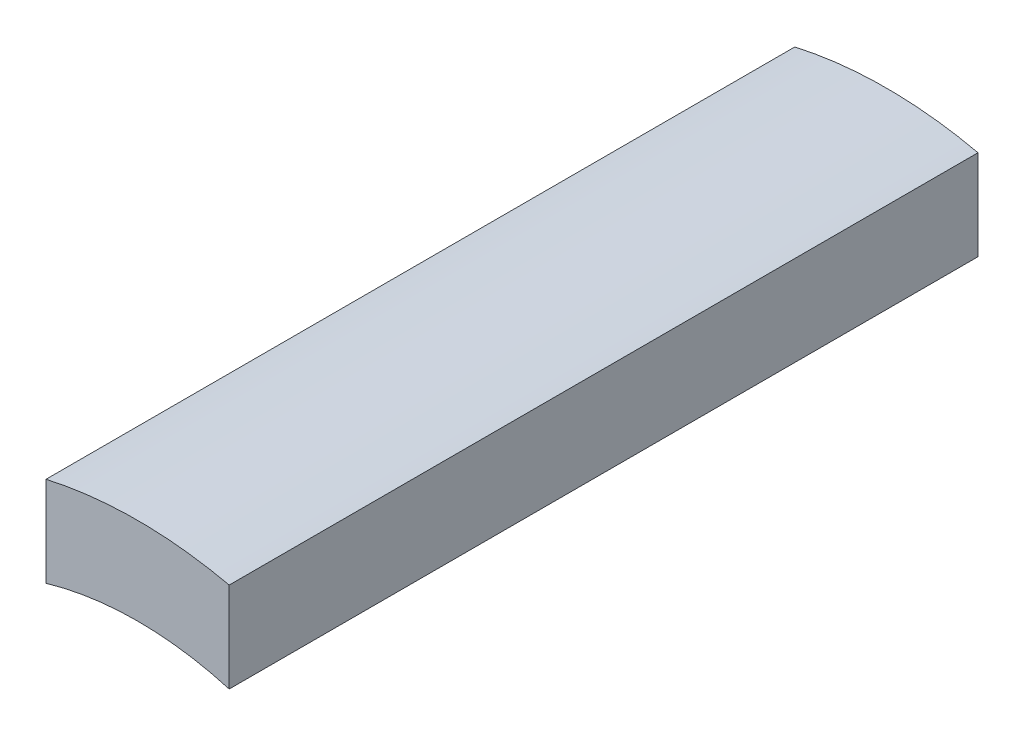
from build123d import *

# Parameters (mm, degrees)
P_IDAT_VYSUNUT_M1_DEPTH = 51.5


with BuildPart() as part:
    # Skica1 → P_idat vysunut_m1 (new body)
    with BuildSketch(Plane.XY):
        with BuildLine():
            Line((-6.3, 21.6), (-6.3, 27.794963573))
            ThreePointArc((-6.3, 27.794963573), (0, 28.5), (6.3, 27.794963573))
            Line((6.3, 27.794963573), (6.3, 21.6))
            ThreePointArc((6.3, 21.6), (0, 22.5), (-6.3, 21.6))
        make_face()
    extrude(amount=P_IDAT_VYSUNUT_M1_DEPTH)


solid = part.part
